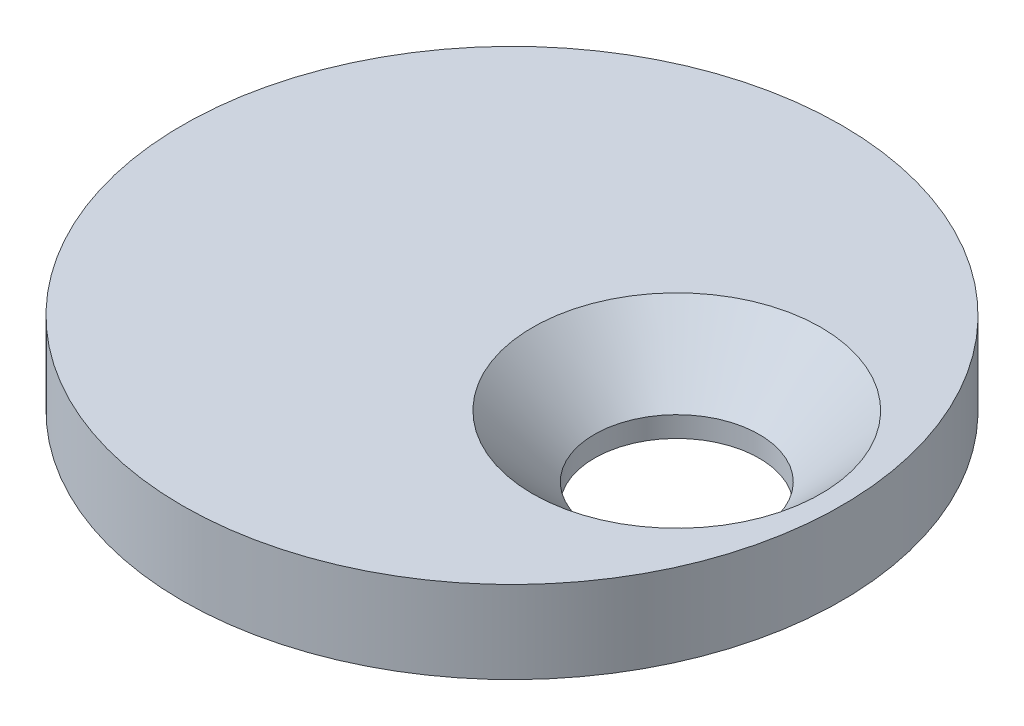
ISO-10303-21;
HEADER;
FILE_DESCRIPTION(('STEP AP214'),'2;1');
FILE_NAME('part.step','',(''),(''),'','','');
FILE_SCHEMA(('AUTOMOTIVE_DESIGN { 1 0 10303 214 1 1 1 1 }'));
ENDSEC;
DATA;
#1=APPLICATION_CONTEXT('core data for automotive mechanical design processes');
#2=APPLICATION_PROTOCOL_DEFINITION('international standard','automotive_design',2000,#1);
#3=PRODUCT_CONTEXT('',#1,'mechanical');
#4=PRODUCT('Part','Part','',(#3));
#5=PRODUCT_RELATED_PRODUCT_CATEGORY('part','',(#4));
#6=PRODUCT_DEFINITION_FORMATION('','',#4);
#7=PRODUCT_DEFINITION_CONTEXT('part definition',#1,'design');
#8=PRODUCT_DEFINITION('design','',#6,#7);
#9=PRODUCT_DEFINITION_SHAPE('','',#8);
#10=(LENGTH_UNIT() NAMED_UNIT(*) SI_UNIT(.MILLI.,.METRE.));
#11=(NAMED_UNIT(*) PLANE_ANGLE_UNIT() SI_UNIT($,.RADIAN.));
#12=(NAMED_UNIT(*) SI_UNIT($,.STERADIAN.) SOLID_ANGLE_UNIT());
#13=UNCERTAINTY_MEASURE_WITH_UNIT(LENGTH_MEASURE(1.E-05),#10,'distance_accuracy_value','');
#14=(GEOMETRIC_REPRESENTATION_CONTEXT(3) GLOBAL_UNCERTAINTY_ASSIGNED_CONTEXT((#13)) GLOBAL_UNIT_ASSIGNED_CONTEXT((#10,
#11,#12)) REPRESENTATION_CONTEXT('',''));
#15=CARTESIAN_POINT('',(0.,0.,0.));
#16=DIRECTION('',(0.,0.,1.));
#17=DIRECTION('',(1.,0.,0.));
#18=AXIS2_PLACEMENT_3D('',#15,#16,#17);
#19=CARTESIAN_POINT('',(0.,3.,0.));
#20=DIRECTION('',(0.,-1.,0.));
#21=DIRECTION('',(0.,0.,-1.));
#22=AXIS2_PLACEMENT_3D('',#19,#20,#21);
#23=CYLINDRICAL_SURFACE('',#22,12.);
#24=CARTESIAN_POINT('',(0.,3.,0.));
#25=DIRECTION('',(0.,1.,0.));
#26=DIRECTION('',(0.,0.,1.));
#27=AXIS2_PLACEMENT_3D('',#24,#25,#26);
#28=CIRCLE('',#27,12.);
#29=CARTESIAN_POINT('',(0.,3.,12.));
#30=VERTEX_POINT('',#29);
#31=EDGE_CURVE('E10',#30,#30,#28,.T.);
#32=ORIENTED_EDGE('',*,*,#31,.F.);
#33=EDGE_LOOP('',(#32));
#34=FACE_BOUND('',#33,.T.);
#35=CARTESIAN_POINT('',(0.,0.,0.));
#36=DIRECTION('',(0.,1.,0.));
#37=DIRECTION('',(0.,0.,1.));
#38=AXIS2_PLACEMENT_3D('',#35,#36,#37);
#39=CIRCLE('',#38,12.);
#40=CARTESIAN_POINT('',(0.,0.,12.));
#41=VERTEX_POINT('',#40);
#42=EDGE_CURVE('E32',#41,#41,#39,.T.);
#43=ORIENTED_EDGE('',*,*,#42,.T.);
#44=EDGE_LOOP('',(#43));
#45=FACE_BOUND('',#44,.T.);
#46=ADVANCED_FACE('F29',(#34,#45),#23,.T.);
#47=CARTESIAN_POINT('',(0.,3.,0.));
#48=DIRECTION('',(0.,1.,0.));
#49=DIRECTION('',(0.,0.,1.));
#50=AXIS2_PLACEMENT_3D('',#47,#48,#49);
#51=PLANE('',#50);
#52=CARTESIAN_POINT('',(6.,3.,0.));
#53=DIRECTION('',(0.,1.,0.));
#54=DIRECTION('',(0.,0.,1.));
#55=AXIS2_PLACEMENT_3D('',#52,#53,#54);
#56=CIRCLE('',#55,5.25);
#57=CARTESIAN_POINT('',(6.,3.,5.25));
#58=VERTEX_POINT('',#57);
#59=EDGE_CURVE('E46',#58,#58,#56,.T.);
#60=ORIENTED_EDGE('',*,*,#59,.F.);
#61=EDGE_LOOP('',(#60));
#62=FACE_BOUND('',#61,.T.);
#63=ORIENTED_EDGE('',*,*,#31,.T.);
#64=EDGE_LOOP('',(#63));
#65=FACE_BOUND('',#64,.T.);
#66=ADVANCED_FACE('F52',(#62,#65),#51,.T.);
#67=CARTESIAN_POINT('',(0.,0.,0.));
#68=DIRECTION('',(0.,1.,0.));
#69=DIRECTION('',(0.,0.,1.));
#70=AXIS2_PLACEMENT_3D('',#67,#68,#69);
#71=PLANE('',#70);
#72=CARTESIAN_POINT('',(6.,0.,0.));
#73=DIRECTION('',(0.,1.,0.));
#74=DIRECTION('',(0.,0.,1.));
#75=AXIS2_PLACEMENT_3D('',#72,#73,#74);
#76=CIRCLE('',#75,3.);
#77=CARTESIAN_POINT('',(6.,0.,3.));
#78=VERTEX_POINT('',#77);
#79=EDGE_CURVE('E39',#78,#78,#76,.T.);
#80=ORIENTED_EDGE('',*,*,#79,.T.);
#81=EDGE_LOOP('',(#80));
#82=FACE_BOUND('',#81,.T.);
#83=ORIENTED_EDGE('',*,*,#42,.F.);
#84=EDGE_LOOP('',(#83));
#85=FACE_BOUND('',#84,.T.);
#86=ADVANCED_FACE('F54',(#82,#85),#71,.F.);
#87=CARTESIAN_POINT('',(6.,3.,0.));
#88=DIRECTION('',(0.,1.,0.));
#89=DIRECTION('',(0.,0.,1.));
#90=AXIS2_PLACEMENT_3D('',#87,#88,#89);
#91=CYLINDRICAL_SURFACE('',#90,3.);
#92=ORIENTED_EDGE('',*,*,#79,.F.);
#93=EDGE_LOOP('',(#92));
#94=FACE_BOUND('',#93,.T.);
#95=CARTESIAN_POINT('',(6.,0.749999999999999,0.));
#96=DIRECTION('',(0.,1.,0.));
#97=DIRECTION('',(0.,0.,1.));
#98=AXIS2_PLACEMENT_3D('',#95,#96,#97);
#99=CIRCLE('',#98,3.);
#100=CARTESIAN_POINT('',(6.,0.749999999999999,3.));
#101=VERTEX_POINT('',#100);
#102=EDGE_CURVE('E43',#101,#101,#99,.T.);
#103=ORIENTED_EDGE('',*,*,#102,.T.);
#104=EDGE_LOOP('',(#103));
#105=FACE_BOUND('',#104,.T.);
#106=ADVANCED_FACE('F60',(#94,#105),#91,.F.);
#107=CARTESIAN_POINT('',(6.,3.,0.));
#108=DIRECTION('',(0.,1.,0.));
#109=DIRECTION('',(0.,0.,1.));
#110=AXIS2_PLACEMENT_3D('',#107,#108,#109);
#111=CONICAL_SURFACE('',#110,5.25,0.785398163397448);
#112=ORIENTED_EDGE('',*,*,#102,.F.);
#113=EDGE_LOOP('',(#112));
#114=FACE_BOUND('',#113,.T.);
#115=ORIENTED_EDGE('',*,*,#59,.T.);
#116=EDGE_LOOP('',(#115));
#117=FACE_BOUND('',#116,.T.);
#118=ADVANCED_FACE('F50',(#114,#117),#111,.F.);
#119=CLOSED_SHELL('',(#46,#66,#86,#106,#118));
#120=MANIFOLD_SOLID_BREP('B2',#119);
#121=ADVANCED_BREP_SHAPE_REPRESENTATION('',(#18,#120),#14);
#122=SHAPE_DEFINITION_REPRESENTATION(#9,#121);
ENDSEC;
END-ISO-10303-21;
